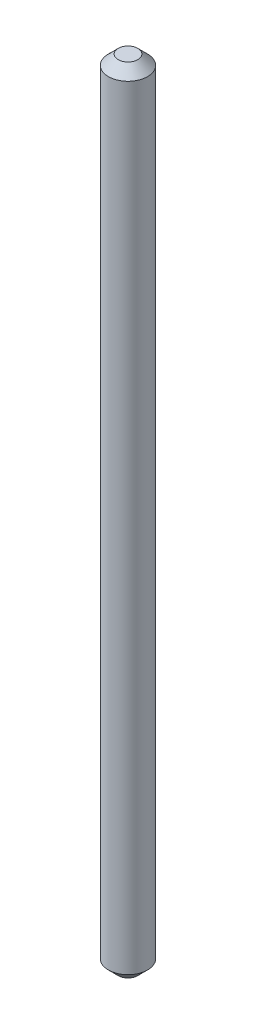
ISO-10303-21;
HEADER;
FILE_DESCRIPTION(('STEP AP214'),'2;1');
FILE_NAME('part.step','',(''),(''),'','','');
FILE_SCHEMA(('AUTOMOTIVE_DESIGN { 1 0 10303 214 1 1 1 1 }'));
ENDSEC;
DATA;
#1=APPLICATION_CONTEXT('core data for automotive mechanical design processes');
#2=APPLICATION_PROTOCOL_DEFINITION('international standard','automotive_design',2000,#1);
#3=PRODUCT_CONTEXT('',#1,'mechanical');
#4=PRODUCT('Part','Part','',(#3));
#5=PRODUCT_RELATED_PRODUCT_CATEGORY('part','',(#4));
#6=PRODUCT_DEFINITION_FORMATION('','',#4);
#7=PRODUCT_DEFINITION_CONTEXT('part definition',#1,'design');
#8=PRODUCT_DEFINITION('design','',#6,#7);
#9=PRODUCT_DEFINITION_SHAPE('','',#8);
#10=(LENGTH_UNIT() NAMED_UNIT(*) SI_UNIT(.MILLI.,.METRE.));
#11=(NAMED_UNIT(*) PLANE_ANGLE_UNIT() SI_UNIT($,.RADIAN.));
#12=(NAMED_UNIT(*) SI_UNIT($,.STERADIAN.) SOLID_ANGLE_UNIT());
#13=UNCERTAINTY_MEASURE_WITH_UNIT(LENGTH_MEASURE(1.E-05),#10,'distance_accuracy_value','');
#14=(GEOMETRIC_REPRESENTATION_CONTEXT(3) GLOBAL_UNCERTAINTY_ASSIGNED_CONTEXT((#13)) GLOBAL_UNIT_ASSIGNED_CONTEXT((#10,
#11,#12)) REPRESENTATION_CONTEXT('',''));
#15=CARTESIAN_POINT('',(0.,0.,0.));
#16=DIRECTION('',(0.,0.,1.));
#17=DIRECTION('',(1.,0.,0.));
#18=AXIS2_PLACEMENT_3D('',#15,#16,#17);
#19=CARTESIAN_POINT('',(0.,81.,0.));
#20=DIRECTION('',(0.,-1.,0.));
#21=DIRECTION('',(0.,0.,-1.));
#22=AXIS2_PLACEMENT_3D('',#19,#20,#21);
#23=CYLINDRICAL_SURFACE('',#22,2.);
#24=CARTESIAN_POINT('',(0.,1.00000000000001,0.));
#25=DIRECTION('',(0.,1.,0.));
#26=DIRECTION('',(0.,0.,1.));
#27=AXIS2_PLACEMENT_3D('',#24,#25,#26);
#28=CIRCLE('',#27,2.);
#29=CARTESIAN_POINT('',(0.,1.00000000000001,2.));
#30=VERTEX_POINT('',#29);
#31=EDGE_CURVE('E40',#30,#30,#28,.T.);
#32=ORIENTED_EDGE('',*,*,#31,.T.);
#33=EDGE_LOOP('',(#32));
#34=FACE_BOUND('',#33,.T.);
#35=CARTESIAN_POINT('',(0.,80.,0.));
#36=DIRECTION('',(0.,1.,0.));
#37=DIRECTION('',(0.,0.,1.));
#38=AXIS2_PLACEMENT_3D('',#35,#36,#37);
#39=CIRCLE('',#38,2.);
#40=CARTESIAN_POINT('',(0.,80.,2.));
#41=VERTEX_POINT('',#40);
#42=EDGE_CURVE('E44',#41,#41,#39,.F.);
#43=ORIENTED_EDGE('',*,*,#42,.T.);
#44=EDGE_LOOP('',(#43));
#45=FACE_BOUND('',#44,.T.);
#46=ADVANCED_FACE('F29',(#34,#45),#23,.T.);
#47=CARTESIAN_POINT('',(0.,81.,0.));
#48=DIRECTION('',(0.,1.,0.));
#49=DIRECTION('',(0.,0.,1.));
#50=AXIS2_PLACEMENT_3D('',#47,#48,#49);
#51=PLANE('',#50);
#52=CARTESIAN_POINT('',(0.,81.,0.));
#53=DIRECTION('',(0.,1.,0.));
#54=DIRECTION('',(0.,0.,1.));
#55=AXIS2_PLACEMENT_3D('',#52,#53,#54);
#56=CIRCLE('',#55,1.00000000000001);
#57=CARTESIAN_POINT('',(0.,81.,1.00000000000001));
#58=VERTEX_POINT('',#57);
#59=EDGE_CURVE('E10',#58,#58,#56,.T.);
#60=ORIENTED_EDGE('',*,*,#59,.T.);
#61=EDGE_LOOP('',(#60));
#62=FACE_BOUND('',#61,.T.);
#63=ADVANCED_FACE('F60',(#62),#51,.T.);
#64=CARTESIAN_POINT('',(0.,0.,0.));
#65=DIRECTION('',(0.,1.,0.));
#66=DIRECTION('',(0.,0.,1.));
#67=AXIS2_PLACEMENT_3D('',#64,#65,#66);
#68=PLANE('',#67);
#69=CARTESIAN_POINT('',(0.,0.,0.));
#70=DIRECTION('',(0.,1.,0.));
#71=DIRECTION('',(0.,0.,1.));
#72=AXIS2_PLACEMENT_3D('',#69,#70,#71);
#73=CIRCLE('',#72,0.999999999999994);
#74=CARTESIAN_POINT('',(0.,0.,0.999999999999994));
#75=VERTEX_POINT('',#74);
#76=EDGE_CURVE('E36',#75,#75,#73,.F.);
#77=ORIENTED_EDGE('',*,*,#76,.T.);
#78=EDGE_LOOP('',(#77));
#79=FACE_BOUND('',#78,.T.);
#80=ADVANCED_FACE('F57',(#79),#68,.F.);
#81=CARTESIAN_POINT('',(0.,1.00000000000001,0.));
#82=DIRECTION('',(0.,1.,0.));
#83=DIRECTION('',(0.,0.,1.));
#84=AXIS2_PLACEMENT_3D('',#81,#82,#83);
#85=CONICAL_SURFACE('',#84,2.,0.785398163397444);
#86=ORIENTED_EDGE('',*,*,#76,.F.);
#87=EDGE_LOOP('',(#86));
#88=FACE_BOUND('',#87,.T.);
#89=ORIENTED_EDGE('',*,*,#31,.F.);
#90=EDGE_LOOP('',(#89));
#91=FACE_BOUND('',#90,.T.);
#92=ADVANCED_FACE('F53',(#88,#91),#85,.T.);
#93=CARTESIAN_POINT('',(0.,81.,0.));
#94=DIRECTION('',(0.,-1.,0.));
#95=DIRECTION('',(0.,0.,-1.));
#96=AXIS2_PLACEMENT_3D('',#93,#94,#95);
#97=CONICAL_SURFACE('',#96,1.00000000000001,0.785398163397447);
#98=ORIENTED_EDGE('',*,*,#42,.F.);
#99=EDGE_LOOP('',(#98));
#100=FACE_BOUND('',#99,.T.);
#101=ORIENTED_EDGE('',*,*,#59,.F.);
#102=EDGE_LOOP('',(#101));
#103=FACE_BOUND('',#102,.T.);
#104=ADVANCED_FACE('F31',(#100,#103),#97,.T.);
#105=CLOSED_SHELL('',(#46,#63,#80,#92,#104));
#106=MANIFOLD_SOLID_BREP('B2',#105);
#107=ADVANCED_BREP_SHAPE_REPRESENTATION('',(#18,#106),#14);
#108=SHAPE_DEFINITION_REPRESENTATION(#9,#107);
ENDSEC;
END-ISO-10303-21;
